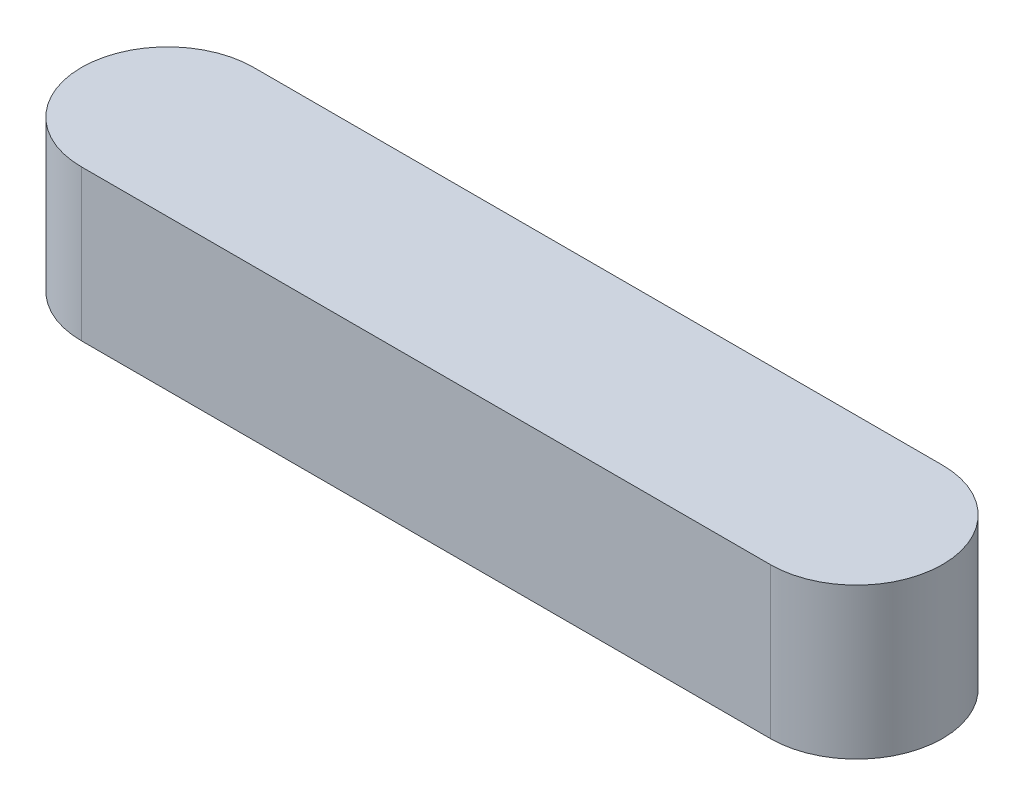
from build123d import *

# Parameters (mm, degrees)
EXTRUDE1_DEPTH = 7


with BuildPart() as part:
    # Sketch1 → Extrude1 (new body)
    with BuildSketch(Plane(origin=(0, 0, 0), x_dir=(1, 0, 0), z_dir=(0, 1, 0))):
        with BuildLine():
            Line((32, 4), (0, 4))
            ThreePointArc((0, 4), (-4, 0), (0, -4))
            Line((0, -4), (32, -4))
            ThreePointArc((32, -4), (36, 0), (32, 4))
        make_face()
    extrude(amount=EXTRUDE1_DEPTH)


solid = part.part
